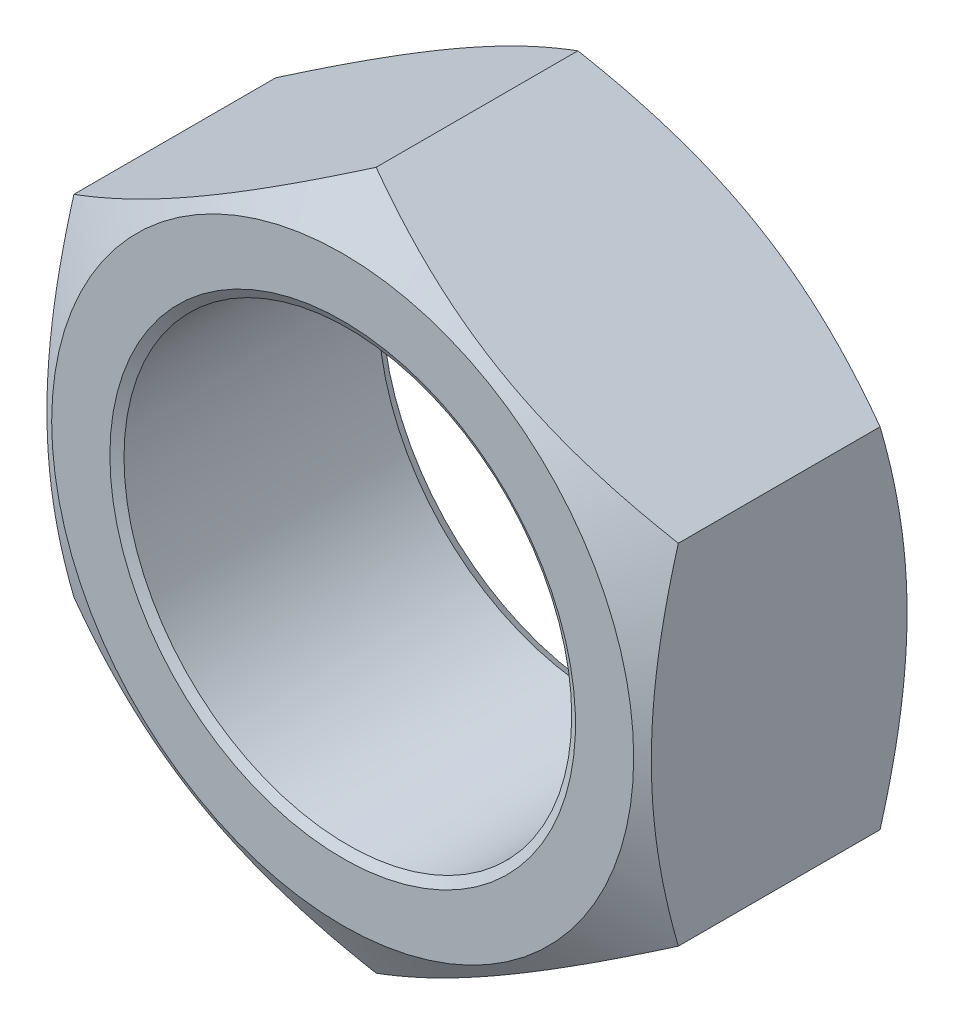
from build123d import *
from OCP.BRepFilletAPI import BRepFilletAPI_MakeChamfer

# Parameters (mm, degrees)
SKETCH2_R               = 12.7
EXTRUDE1_DEPTH          = 7.62
SKETCH3_OUTSIDE_W       = 155.63
SKETCH3_OUTSIDE_H       = 160.934
SKETCH3_OUTSIDE_R       = 16.51
CUT_EXTRUDE1_DEPTH      = 31.300879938
CUT_EXTRUDE1_DRAFT      = -60
MIRROR1_COPY_1_SKETCH_W = 155.63
MIRROR1_COPY_1_SKETCH_H = 160.934
MIRROR1_COPY_1_SKETCH_R = 16.51
MIRROR1_COPY_1_DEPTH    = 31.300879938
MIRROR1_COPY_1_DRAFT    = -60
CHAMFER1_SIZE           = 0.508
CHAMFER1_SIZE2          = 0.293293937


with BuildPart() as part:
    # Sketch2 → Extrude1 (new, symmetric)
    with BuildSketch(Plane.XY):
        Polygon((0, 19.797340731), (-17.145, 9.898670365), (-17.145, -9.898670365), (0, -19.797340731), (17.145, -9.898670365), (17.145, 9.898670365), align=None)
        Circle(SKETCH2_R, mode=Mode.SUBTRACT)
    extrude(amount=EXTRUDE1_DEPTH, both=True)


with BuildPart() as cut_extrude1_tool:
    # Sketch3 outside → Cut-Extrude1 (with draft: the straight prism first)
    with BuildSketch(Plane.XY.offset(7.62)):
        Rectangle(SKETCH3_OUTSIDE_W, SKETCH3_OUTSIDE_H)
        Circle(SKETCH3_OUTSIDE_R, mode=Mode.SUBTRACT)
    extrude(amount=-CUT_EXTRUDE1_DEPTH)
    # Cut-Extrude1: the draft: its side faces are tilted about the plane it starts from
    cut_extrude1_sides = [cut_extrude1_tool.faces().sort_by_distance(p)[0] for p in [
        (0, -80.467, -8.030439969),
        (77.815, 0, -8.030439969),
        (0, 80.467, -8.030439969),
        (-77.815, 0, -8.030439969),
        (-16.51, 0, -8.030439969),
    ]]
    draft(cut_extrude1_sides, Plane.XY.offset(7.62), CUT_EXTRUDE1_DRAFT)


with BuildPart() as part_1:
    add(part.part)

    # Cut-Extrude1: cut by cut_extrude1_tool
    add(cut_extrude1_tool.part, mode=Mode.SUBTRACT)


with BuildPart() as mirror1_copy_1_tool:
    # Mirror1 copy 1 sketch → Mirror1 copy 1 (with draft: the straight prism first)
    with BuildSketch(Plane(origin=(0, 0, -7.62), x_dir=(1, 0, 0), z_dir=(0, 0, -1))):
        Rectangle(MIRROR1_COPY_1_SKETCH_W, MIRROR1_COPY_1_SKETCH_H)
        Circle(MIRROR1_COPY_1_SKETCH_R, mode=Mode.SUBTRACT)
    extrude(amount=-MIRROR1_COPY_1_DEPTH)
    # Mirror1 copy 1: the draft: its side faces are tilted about the plane it starts from
    mirror1_copy_1_sides = [mirror1_copy_1_tool.faces().sort_by_distance(p)[0] for p in [
        (0, -80.467, 8.030439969),
        (77.815, 0, 8.030439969),
        (0, 80.467, 8.030439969),
        (-77.815, 0, 8.030439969),
        (-16.51, 0, 8.030439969),
    ]]
    draft(mirror1_copy_1_sides, Plane(origin=(0, 0, -7.62), x_dir=(1, 0, 0), z_dir=(0, 0, -1)), MIRROR1_COPY_1_DRAFT)


with BuildPart() as part_2:
    add(part_1.part)

    # Mirror1 copy 1: cut by mirror1_copy_1_tool
    add(mirror1_copy_1_tool.part, mode=Mode.SUBTRACT)

    # Chamfer1: one chamfer whose edges measure the first distance from different faces: ONE call of the kernel's chamfer builder (chamfer() names one face for all edges)
    chamfer1_edges_1 = [part_2.edges().sort_by_distance(p)[0] for p in [
        (-12.7, 0, -7.62),
    ]]
    chamfer1_side_1 = [part_2.faces().sort_by_distance(p)[0] for p in [
        (-12.7, 0, 0),
    ]]
    chamfer1_edges_2 = [part_2.edges().sort_by_distance(p)[0] for p in [
        (-12.7, 0, 7.62),
    ]]
    chamfer1_side_2 = [part_2.faces().sort_by_distance(p)[0] for p in [
        (-16.043026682, 0, 7.62),
    ]]
    chamfer1 = BRepFilletAPI_MakeChamfer(part_2.part.solid().wrapped)
    for e in chamfer1_edges_1:
        chamfer1.Add(CHAMFER1_SIZE, CHAMFER1_SIZE2, e.wrapped, chamfer1_side_1[0].wrapped)  # the first distance lies on this face
    for e in chamfer1_edges_2:
        chamfer1.Add(CHAMFER1_SIZE, CHAMFER1_SIZE2, e.wrapped, chamfer1_side_2[0].wrapped)  # the first distance lies on this face
    add(Compound.cast(chamfer1.Shape()), mode=Mode.REPLACE)


solid = part_2.part
